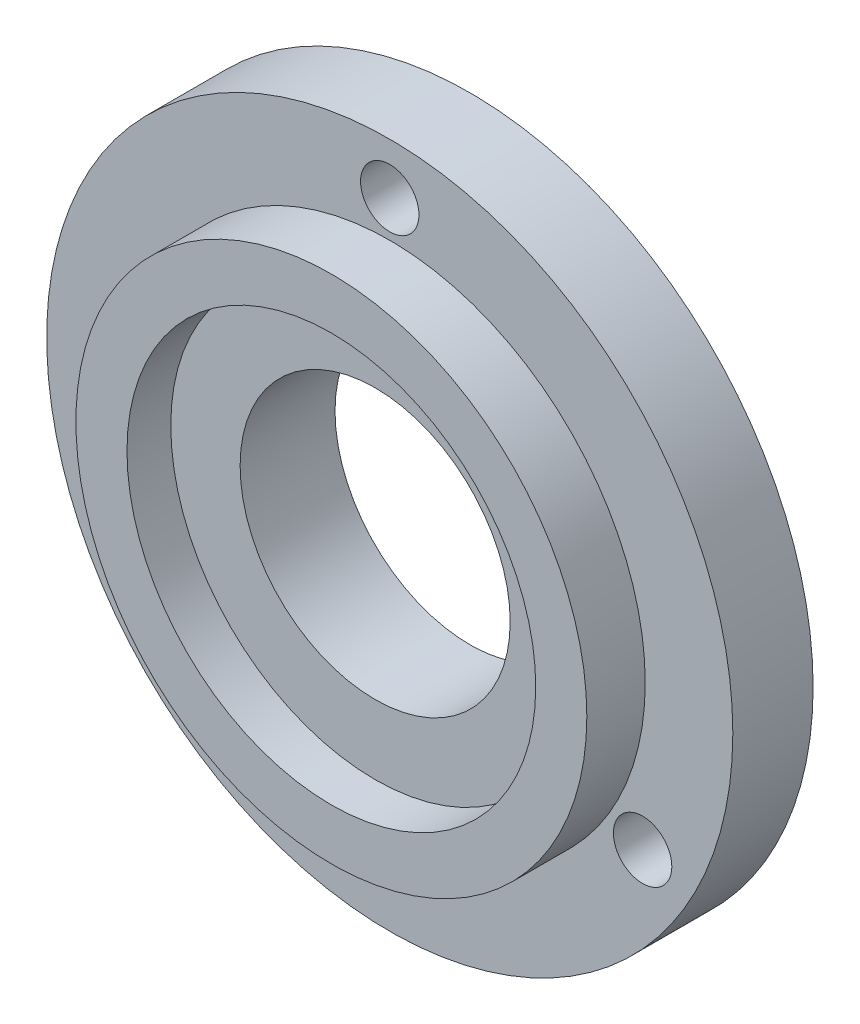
ISO-10303-21;
HEADER;
FILE_DESCRIPTION(('STEP AP214'),'2;1');
FILE_NAME('part.step','',(''),(''),'','','');
FILE_SCHEMA(('AUTOMOTIVE_DESIGN { 1 0 10303 214 1 1 1 1 }'));
ENDSEC;
DATA;
#1=APPLICATION_CONTEXT('core data for automotive mechanical design processes');
#2=APPLICATION_PROTOCOL_DEFINITION('international standard','automotive_design',2000,#1);
#3=PRODUCT_CONTEXT('',#1,'mechanical');
#4=PRODUCT('Part','Part','',(#3));
#5=PRODUCT_RELATED_PRODUCT_CATEGORY('part','',(#4));
#6=PRODUCT_DEFINITION_FORMATION('','',#4);
#7=PRODUCT_DEFINITION_CONTEXT('part definition',#1,'design');
#8=PRODUCT_DEFINITION('design','',#6,#7);
#9=PRODUCT_DEFINITION_SHAPE('','',#8);
#10=(LENGTH_UNIT() NAMED_UNIT(*) SI_UNIT(.MILLI.,.METRE.));
#11=(NAMED_UNIT(*) PLANE_ANGLE_UNIT() SI_UNIT($,.RADIAN.));
#12=(NAMED_UNIT(*) SI_UNIT($,.STERADIAN.) SOLID_ANGLE_UNIT());
#13=UNCERTAINTY_MEASURE_WITH_UNIT(LENGTH_MEASURE(1.E-05),#10,'distance_accuracy_value','');
#14=(GEOMETRIC_REPRESENTATION_CONTEXT(3) GLOBAL_UNCERTAINTY_ASSIGNED_CONTEXT((#13)) GLOBAL_UNIT_ASSIGNED_CONTEXT((#10,
#11,#12)) REPRESENTATION_CONTEXT('',''));
#15=CARTESIAN_POINT('',(0.,0.,0.));
#16=DIRECTION('',(0.,0.,1.));
#17=DIRECTION('',(1.,0.,0.));
#18=AXIS2_PLACEMENT_3D('',#15,#16,#17);
#19=CARTESIAN_POINT('',(0.,0.,9.5));
#20=DIRECTION('',(0.,0.,-1.));
#21=DIRECTION('',(-1.,0.,0.));
#22=AXIS2_PLACEMENT_3D('',#19,#20,#21);
#23=CYLINDRICAL_SURFACE('',#22,23.5);
#24=CARTESIAN_POINT('',(0.,0.,0.));
#25=DIRECTION('',(0.,0.,1.));
#26=DIRECTION('',(1.,0.,0.));
#27=AXIS2_PLACEMENT_3D('',#24,#25,#26);
#28=CIRCLE('',#27,23.5);
#29=CARTESIAN_POINT('',(23.5,0.,0.));
#30=VERTEX_POINT('',#29);
#31=EDGE_CURVE('E10',#30,#30,#28,.T.);
#32=ORIENTED_EDGE('',*,*,#31,.T.);
#33=EDGE_LOOP('',(#32));
#34=FACE_BOUND('',#33,.T.);
#35=CARTESIAN_POINT('',(0.,0.,5.5));
#36=DIRECTION('',(0.,0.,1.));
#37=DIRECTION('',(1.,0.,0.));
#38=AXIS2_PLACEMENT_3D('',#35,#36,#37);
#39=CIRCLE('',#38,23.5);
#40=CARTESIAN_POINT('',(23.5,0.,5.5));
#41=VERTEX_POINT('',#40);
#42=EDGE_CURVE('E36',#41,#41,#39,.T.);
#43=ORIENTED_EDGE('',*,*,#42,.F.);
#44=EDGE_LOOP('',(#43));
#45=FACE_BOUND('',#44,.T.);
#46=ADVANCED_FACE('F29',(#34,#45),#23,.T.);
#47=CARTESIAN_POINT('',(0.,0.,0.));
#48=DIRECTION('',(0.,0.,1.));
#49=DIRECTION('',(1.,0.,0.));
#50=AXIS2_PLACEMENT_3D('',#47,#48,#49);
#51=PLANE('',#50);
#52=CARTESIAN_POINT('',(-17.3205080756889,-9.99999999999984,0.));
#53=DIRECTION('',(0.,0.,-1.));
#54=DIRECTION('',(0.499999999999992,-0.866025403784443,0.));
#55=AXIS2_PLACEMENT_3D('',#52,#53,#54);
#56=CIRCLE('',#55,2.);
#57=CARTESIAN_POINT('',(-16.3205080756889,-11.7320508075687,0.));
#58=VERTEX_POINT('',#57);
#59=EDGE_CURVE('E65',#58,#58,#56,.T.);
#60=ORIENTED_EDGE('',*,*,#59,.F.);
#61=EDGE_LOOP('',(#60));
#62=FACE_BOUND('',#61,.T.);
#63=CARTESIAN_POINT('',(17.3205080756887,-10.0000000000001,0.));
#64=DIRECTION('',(0.,0.,-1.));
#65=DIRECTION('',(0.500000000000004,0.866025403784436,0.));
#66=AXIS2_PLACEMENT_3D('',#63,#64,#65);
#67=CIRCLE('',#66,2.);
#68=CARTESIAN_POINT('',(18.3205080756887,-8.26794919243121,0.));
#69=VERTEX_POINT('',#68);
#70=EDGE_CURVE('E55',#69,#69,#67,.T.);
#71=ORIENTED_EDGE('',*,*,#70,.F.);
#72=EDGE_LOOP('',(#71));
#73=FACE_BOUND('',#72,.T.);
#74=CARTESIAN_POINT('',(0.,20.,0.));
#75=DIRECTION('',(0.,0.,-1.));
#76=DIRECTION('',(-1.,0.,0.));
#77=AXIS2_PLACEMENT_3D('',#74,#75,#76);
#78=CIRCLE('',#77,2.);
#79=CARTESIAN_POINT('',(-2.,20.,0.));
#80=VERTEX_POINT('',#79);
#81=EDGE_CURVE('E52',#80,#80,#78,.T.);
#82=ORIENTED_EDGE('',*,*,#81,.F.);
#83=EDGE_LOOP('',(#82));
#84=FACE_BOUND('',#83,.T.);
#85=CARTESIAN_POINT('',(0.,0.,0.));
#86=DIRECTION('',(0.,0.,-1.));
#87=DIRECTION('',(-1.,0.,0.));
#88=AXIS2_PLACEMENT_3D('',#85,#86,#87);
#89=CIRCLE('',#88,9.25);
#90=CARTESIAN_POINT('',(-9.25,0.,0.));
#91=VERTEX_POINT('',#90);
#92=EDGE_CURVE('E49',#91,#91,#89,.T.);
#93=ORIENTED_EDGE('',*,*,#92,.F.);
#94=EDGE_LOOP('',(#93));
#95=FACE_BOUND('',#94,.T.);
#96=ORIENTED_EDGE('',*,*,#31,.F.);
#97=EDGE_LOOP('',(#96));
#98=FACE_BOUND('',#97,.T.);
#99=ADVANCED_FACE('F86',(#62,#73,#84,#95,#98),#51,.F.);
#100=CARTESIAN_POINT('',(0.,0.,5.5));
#101=DIRECTION('',(0.,0.,1.));
#102=DIRECTION('',(1.,0.,0.));
#103=AXIS2_PLACEMENT_3D('',#100,#101,#102);
#104=PLANE('',#103);
#105=CARTESIAN_POINT('',(-17.3205080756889,-9.99999999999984,5.5));
#106=DIRECTION('',(0.,0.,1.));
#107=DIRECTION('',(1.,0.,0.));
#108=AXIS2_PLACEMENT_3D('',#105,#106,#107);
#109=CIRCLE('',#108,2.);
#110=CARTESIAN_POINT('',(-15.3205080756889,-9.99999999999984,5.5));
#111=VERTEX_POINT('',#110);
#112=EDGE_CURVE('E32',#111,#111,#109,.T.);
#113=ORIENTED_EDGE('',*,*,#112,.F.);
#114=EDGE_LOOP('',(#113));
#115=FACE_BOUND('',#114,.T.);
#116=CARTESIAN_POINT('',(17.3205080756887,-10.0000000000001,5.5));
#117=DIRECTION('',(0.,0.,1.));
#118=DIRECTION('',(1.,0.,0.));
#119=AXIS2_PLACEMENT_3D('',#116,#117,#118);
#120=CIRCLE('',#119,2.);
#121=CARTESIAN_POINT('',(19.3205080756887,-10.0000000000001,5.5));
#122=VERTEX_POINT('',#121);
#123=EDGE_CURVE('E53',#122,#122,#120,.T.);
#124=ORIENTED_EDGE('',*,*,#123,.F.);
#125=EDGE_LOOP('',(#124));
#126=FACE_BOUND('',#125,.T.);
#127=CARTESIAN_POINT('',(0.,20.,5.5));
#128=DIRECTION('',(0.,0.,1.));
#129=DIRECTION('',(1.,0.,0.));
#130=AXIS2_PLACEMENT_3D('',#127,#128,#129);
#131=CIRCLE('',#130,2.);
#132=CARTESIAN_POINT('',(2.,20.,5.5));
#133=VERTEX_POINT('',#132);
#134=EDGE_CURVE('E50',#133,#133,#131,.T.);
#135=ORIENTED_EDGE('',*,*,#134,.F.);
#136=EDGE_LOOP('',(#135));
#137=FACE_BOUND('',#136,.T.);
#138=CARTESIAN_POINT('',(0.,0.,5.5));
#139=DIRECTION('',(0.,0.,1.));
#140=DIRECTION('',(1.,0.,0.));
#141=AXIS2_PLACEMENT_3D('',#138,#139,#140);
#142=CIRCLE('',#141,17.5);
#143=CARTESIAN_POINT('',(17.5,0.,5.5));
#144=VERTEX_POINT('',#143);
#145=EDGE_CURVE('E41',#144,#144,#142,.T.);
#146=ORIENTED_EDGE('',*,*,#145,.F.);
#147=EDGE_LOOP('',(#146));
#148=FACE_BOUND('',#147,.T.);
#149=ORIENTED_EDGE('',*,*,#42,.T.);
#150=EDGE_LOOP('',(#149));
#151=FACE_BOUND('',#150,.T.);
#152=ADVANCED_FACE('F83',(#115,#126,#137,#148,#151),#104,.T.);
#153=CARTESIAN_POINT('',(0.,0.,5.5));
#154=DIRECTION('',(0.,0.,1.));
#155=DIRECTION('',(1.,0.,0.));
#156=AXIS2_PLACEMENT_3D('',#153,#154,#155);
#157=CYLINDRICAL_SURFACE('',#156,17.5);
#158=ORIENTED_EDGE('',*,*,#145,.T.);
#159=EDGE_LOOP('',(#158));
#160=FACE_BOUND('',#159,.T.);
#161=CARTESIAN_POINT('',(0.,0.,9.5));
#162=DIRECTION('',(0.,0.,1.));
#163=DIRECTION('',(1.,0.,0.));
#164=AXIS2_PLACEMENT_3D('',#161,#162,#163);
#165=CIRCLE('',#164,17.5);
#166=CARTESIAN_POINT('',(17.5,0.,9.5));
#167=VERTEX_POINT('',#166);
#168=EDGE_CURVE('E75',#167,#167,#165,.T.);
#169=ORIENTED_EDGE('',*,*,#168,.F.);
#170=EDGE_LOOP('',(#169));
#171=FACE_BOUND('',#170,.T.);
#172=ADVANCED_FACE('F80',(#160,#171),#157,.T.);
#173=CARTESIAN_POINT('',(0.,0.,9.5));
#174=DIRECTION('',(0.,0.,1.));
#175=DIRECTION('',(1.,0.,0.));
#176=AXIS2_PLACEMENT_3D('',#173,#174,#175);
#177=PLANE('',#176);
#178=CARTESIAN_POINT('',(0.,0.,9.5));
#179=DIRECTION('',(0.,0.,1.));
#180=DIRECTION('',(1.,0.,0.));
#181=AXIS2_PLACEMENT_3D('',#178,#179,#180);
#182=CIRCLE('',#181,14.);
#183=CARTESIAN_POINT('',(14.,0.,9.5));
#184=VERTEX_POINT('',#183);
#185=EDGE_CURVE('E48',#184,#184,#182,.T.);
#186=ORIENTED_EDGE('',*,*,#185,.F.);
#187=EDGE_LOOP('',(#186));
#188=FACE_BOUND('',#187,.T.);
#189=ORIENTED_EDGE('',*,*,#168,.T.);
#190=EDGE_LOOP('',(#189));
#191=FACE_BOUND('',#190,.T.);
#192=ADVANCED_FACE('F102',(#188,#191),#177,.T.);
#193=CARTESIAN_POINT('',(0.,0.,6.5));
#194=DIRECTION('',(0.,0.,1.));
#195=DIRECTION('',(1.,0.,0.));
#196=AXIS2_PLACEMENT_3D('',#193,#194,#195);
#197=CYLINDRICAL_SURFACE('',#196,14.);
#198=CARTESIAN_POINT('',(0.,0.,6.5));
#199=DIRECTION('',(0.,0.,1.));
#200=DIRECTION('',(1.,0.,0.));
#201=AXIS2_PLACEMENT_3D('',#198,#199,#200);
#202=CIRCLE('',#201,14.);
#203=CARTESIAN_POINT('',(14.,0.,6.5));
#204=VERTEX_POINT('',#203);
#205=EDGE_CURVE('E72',#204,#204,#202,.T.);
#206=ORIENTED_EDGE('',*,*,#205,.F.);
#207=EDGE_LOOP('',(#206));
#208=FACE_BOUND('',#207,.T.);
#209=ORIENTED_EDGE('',*,*,#185,.T.);
#210=EDGE_LOOP('',(#209));
#211=FACE_BOUND('',#210,.T.);
#212=ADVANCED_FACE('F104',(#208,#211),#197,.F.);
#213=CARTESIAN_POINT('',(0.,0.,6.5));
#214=DIRECTION('',(0.,0.,1.));
#215=DIRECTION('',(1.,0.,0.));
#216=AXIS2_PLACEMENT_3D('',#213,#214,#215);
#217=PLANE('',#216);
#218=CARTESIAN_POINT('',(0.,0.,6.5));
#219=DIRECTION('',(0.,0.,1.));
#220=DIRECTION('',(1.,0.,0.));
#221=AXIS2_PLACEMENT_3D('',#218,#219,#220);
#222=CIRCLE('',#221,9.25);
#223=CARTESIAN_POINT('',(9.25,0.,6.5));
#224=VERTEX_POINT('',#223);
#225=EDGE_CURVE('E45',#224,#224,#222,.T.);
#226=ORIENTED_EDGE('',*,*,#225,.F.);
#227=EDGE_LOOP('',(#226));
#228=FACE_BOUND('',#227,.T.);
#229=ORIENTED_EDGE('',*,*,#205,.T.);
#230=EDGE_LOOP('',(#229));
#231=FACE_BOUND('',#230,.T.);
#232=ADVANCED_FACE('F110',(#228,#231),#217,.T.);
#233=CARTESIAN_POINT('',(0.,0.,9.5));
#234=DIRECTION('',(0.,0.,-1.));
#235=DIRECTION('',(-1.,0.,0.));
#236=AXIS2_PLACEMENT_3D('',#233,#234,#235);
#237=CYLINDRICAL_SURFACE('',#236,9.25);
#238=ORIENTED_EDGE('',*,*,#225,.T.);
#239=EDGE_LOOP('',(#238));
#240=FACE_BOUND('',#239,.T.);
#241=ORIENTED_EDGE('',*,*,#92,.T.);
#242=EDGE_LOOP('',(#241));
#243=FACE_BOUND('',#242,.T.);
#244=ADVANCED_FACE('F122',(#240,#243),#237,.F.);
#245=CARTESIAN_POINT('',(0.,20.,9.5));
#246=DIRECTION('',(0.,0.,-1.));
#247=DIRECTION('',(-1.,0.,0.));
#248=AXIS2_PLACEMENT_3D('',#245,#246,#247);
#249=CYLINDRICAL_SURFACE('',#248,2.);
#250=ORIENTED_EDGE('',*,*,#134,.T.);
#251=EDGE_LOOP('',(#250));
#252=FACE_BOUND('',#251,.T.);
#253=ORIENTED_EDGE('',*,*,#81,.T.);
#254=EDGE_LOOP('',(#253));
#255=FACE_BOUND('',#254,.T.);
#256=ADVANCED_FACE('F126',(#252,#255),#249,.F.);
#257=CARTESIAN_POINT('',(17.3205080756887,-10.0000000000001,9.5));
#258=DIRECTION('',(0.,0.,-1.));
#259=DIRECTION('',(-1.,0.,0.));
#260=AXIS2_PLACEMENT_3D('',#257,#258,#259);
#261=CYLINDRICAL_SURFACE('',#260,2.);
#262=ORIENTED_EDGE('',*,*,#123,.T.);
#263=EDGE_LOOP('',(#262));
#264=FACE_BOUND('',#263,.T.);
#265=ORIENTED_EDGE('',*,*,#70,.T.);
#266=EDGE_LOOP('',(#265));
#267=FACE_BOUND('',#266,.T.);
#268=ADVANCED_FACE('F130',(#264,#267),#261,.F.);
#269=CARTESIAN_POINT('',(-17.3205080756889,-9.99999999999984,9.5));
#270=DIRECTION('',(0.,0.,-1.));
#271=DIRECTION('',(-1.,0.,0.));
#272=AXIS2_PLACEMENT_3D('',#269,#270,#271);
#273=CYLINDRICAL_SURFACE('',#272,2.);
#274=ORIENTED_EDGE('',*,*,#112,.T.);
#275=EDGE_LOOP('',(#274));
#276=FACE_BOUND('',#275,.T.);
#277=ORIENTED_EDGE('',*,*,#59,.T.);
#278=EDGE_LOOP('',(#277));
#279=FACE_BOUND('',#278,.T.);
#280=ADVANCED_FACE('F134',(#276,#279),#273,.F.);
#281=CLOSED_SHELL('',(#46,#99,#152,#172,#192,#212,#232,#244,#256,#268,#280));
#282=MANIFOLD_SOLID_BREP('B2',#281);
#283=ADVANCED_BREP_SHAPE_REPRESENTATION('',(#18,#282),#14);
#284=SHAPE_DEFINITION_REPRESENTATION(#9,#283);
ENDSEC;
END-ISO-10303-21;
